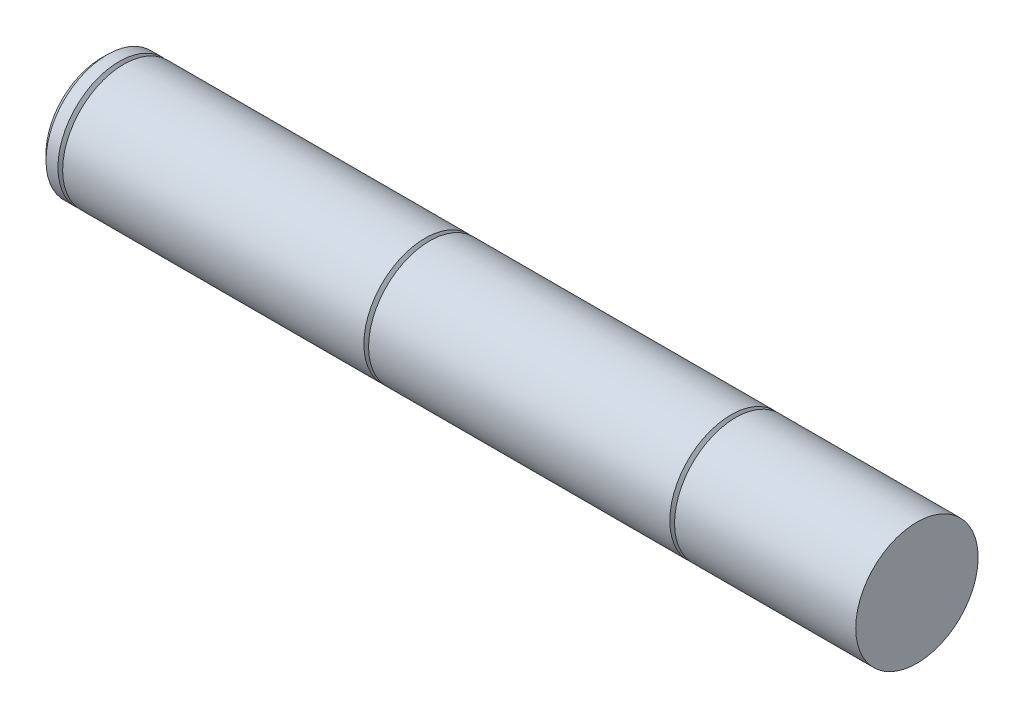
ISO-10303-21;
HEADER;
FILE_DESCRIPTION(('STEP AP214'),'2;1');
FILE_NAME('part.step','',(''),(''),'','','');
FILE_SCHEMA(('AUTOMOTIVE_DESIGN { 1 0 10303 214 1 1 1 1 }'));
ENDSEC;
DATA;
#1=APPLICATION_CONTEXT('core data for automotive mechanical design processes');
#2=APPLICATION_PROTOCOL_DEFINITION('international standard','automotive_design',2000,#1);
#3=PRODUCT_CONTEXT('',#1,'mechanical');
#4=PRODUCT('Part','Part','',(#3));
#5=PRODUCT_RELATED_PRODUCT_CATEGORY('part','',(#4));
#6=PRODUCT_DEFINITION_FORMATION('','',#4);
#7=PRODUCT_DEFINITION_CONTEXT('part definition',#1,'design');
#8=PRODUCT_DEFINITION('design','',#6,#7);
#9=PRODUCT_DEFINITION_SHAPE('','',#8);
#10=(LENGTH_UNIT() NAMED_UNIT(*) SI_UNIT(.MILLI.,.METRE.));
#11=(NAMED_UNIT(*) PLANE_ANGLE_UNIT() SI_UNIT($,.RADIAN.));
#12=(NAMED_UNIT(*) SI_UNIT($,.STERADIAN.) SOLID_ANGLE_UNIT());
#13=UNCERTAINTY_MEASURE_WITH_UNIT(LENGTH_MEASURE(1.E-05),#10,'distance_accuracy_value','');
#14=(GEOMETRIC_REPRESENTATION_CONTEXT(3) GLOBAL_UNCERTAINTY_ASSIGNED_CONTEXT((#13)) GLOBAL_UNIT_ASSIGNED_CONTEXT((#10,
#11,#12)) REPRESENTATION_CONTEXT('',''));
#15=CARTESIAN_POINT('',(0.,0.,0.));
#16=DIRECTION('',(0.,0.,1.));
#17=DIRECTION('',(1.,0.,0.));
#18=AXIS2_PLACEMENT_3D('',#15,#16,#17);
#19=CARTESIAN_POINT('',(0.,0.,0.));
#20=DIRECTION('',(1.,0.,0.));
#21=DIRECTION('',(0.,0.,-1.));
#22=AXIS2_PLACEMENT_3D('',#19,#20,#21);
#23=PLANE('',#22);
#24=CARTESIAN_POINT('',(0.,0.,0.));
#25=DIRECTION('',(1.,0.,0.));
#26=DIRECTION('',(0.,0.,-1.));
#27=AXIS2_PLACEMENT_3D('',#24,#25,#26);
#28=CIRCLE('',#27,13.5);
#29=CARTESIAN_POINT('',(0.,0.,-13.5));
#30=VERTEX_POINT('',#29);
#31=EDGE_CURVE('E17',#30,#30,#28,.T.);
#32=ORIENTED_EDGE('',*,*,#31,.F.);
#33=EDGE_LOOP('',(#32));
#34=FACE_BOUND('',#33,.T.);
#35=ADVANCED_FACE('F14',(#34),#23,.F.);
#36=CARTESIAN_POINT('',(1.50000000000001,0.,0.));
#37=DIRECTION('',(1.,0.,0.));
#38=DIRECTION('',(0.,0.,-1.));
#39=AXIS2_PLACEMENT_3D('',#36,#37,#38);
#40=CONICAL_SURFACE('',#39,15.,0.78539816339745);
#41=CARTESIAN_POINT('',(1.50000000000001,0.,0.));
#42=DIRECTION('',(-1.,0.,0.));
#43=DIRECTION('',(0.,0.,1.));
#44=AXIS2_PLACEMENT_3D('',#41,#42,#43);
#45=CIRCLE('',#44,15.);
#46=CARTESIAN_POINT('',(1.50000000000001,0.,15.));
#47=VERTEX_POINT('',#46);
#48=EDGE_CURVE('E50',#47,#47,#45,.F.);
#49=ORIENTED_EDGE('',*,*,#48,.F.);
#50=EDGE_LOOP('',(#49));
#51=FACE_BOUND('',#50,.T.);
#52=ORIENTED_EDGE('',*,*,#31,.T.);
#53=EDGE_LOOP('',(#52));
#54=FACE_BOUND('',#53,.T.);
#55=ADVANCED_FACE('F173',(#51,#54),#40,.T.);
#56=CARTESIAN_POINT('',(-14.6487659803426,0.,0.));
#57=DIRECTION('',(-1.,0.,0.));
#58=DIRECTION('',(0.,0.,1.));
#59=AXIS2_PLACEMENT_3D('',#56,#57,#58);
#60=CYLINDRICAL_SURFACE('',#59,15.);
#61=ORIENTED_EDGE('',*,*,#48,.T.);
#62=EDGE_LOOP('',(#61));
#63=FACE_BOUND('',#62,.T.);
#64=CARTESIAN_POINT('',(4.42264973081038,0.,0.));
#65=DIRECTION('',(-1.,0.,0.));
#66=DIRECTION('',(0.,0.,1.));
#67=AXIS2_PLACEMENT_3D('',#64,#65,#66);
#68=CIRCLE('',#67,15.);
#69=CARTESIAN_POINT('',(4.42264973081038,0.,15.));
#70=VERTEX_POINT('',#69);
#71=EDGE_CURVE('E47',#70,#70,#68,.F.);
#72=ORIENTED_EDGE('',*,*,#71,.F.);
#73=EDGE_LOOP('',(#72));
#74=FACE_BOUND('',#73,.T.);
#75=ADVANCED_FACE('F69',(#63,#74),#60,.T.);
#76=CARTESIAN_POINT('',(4.42264973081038,0.,0.));
#77=DIRECTION('',(-1.,0.,0.));
#78=DIRECTION('',(0.,0.,1.));
#79=AXIS2_PLACEMENT_3D('',#76,#77,#78);
#80=CONICAL_SURFACE('',#79,15.,1.0471975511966);
#81=ORIENTED_EDGE('',*,*,#71,.T.);
#82=EDGE_LOOP('',(#81));
#83=FACE_BOUND('',#82,.T.);
#84=CARTESIAN_POINT('',(5.00000000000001,0.,0.));
#85=DIRECTION('',(1.,0.,0.));
#86=DIRECTION('',(0.,0.,-1.));
#87=AXIS2_PLACEMENT_3D('',#84,#85,#86);
#88=CIRCLE('',#87,14.);
#89=CARTESIAN_POINT('',(5.00000000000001,0.,-14.));
#90=VERTEX_POINT('',#89);
#91=EDGE_CURVE('E44',#90,#90,#88,.T.);
#92=ORIENTED_EDGE('',*,*,#91,.F.);
#93=EDGE_LOOP('',(#92));
#94=FACE_BOUND('',#93,.T.);
#95=ADVANCED_FACE('F60',(#83,#94),#80,.T.);
#96=CARTESIAN_POINT('',(200.,15.,0.));
#97=DIRECTION('',(-1.,0.,0.));
#98=DIRECTION('',(0.,0.,1.));
#99=AXIS2_PLACEMENT_3D('',#96,#97,#98);
#100=PLANE('',#99);
#101=CARTESIAN_POINT('',(200.,0.,0.));
#102=DIRECTION('',(-1.,0.,0.));
#103=DIRECTION('',(0.,0.,1.));
#104=AXIS2_PLACEMENT_3D('',#101,#102,#103);
#105=CIRCLE('',#104,15.);
#106=CARTESIAN_POINT('',(200.,0.,15.));
#107=VERTEX_POINT('',#106);
#108=EDGE_CURVE('E43',#107,#107,#105,.T.);
#109=ORIENTED_EDGE('',*,*,#108,.F.);
#110=EDGE_LOOP('',(#109));
#111=FACE_BOUND('',#110,.T.);
#112=ADVANCED_FACE('F57',(#111),#100,.F.);
#113=CARTESIAN_POINT('',(5.57735026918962,0.,0.));
#114=DIRECTION('',(1.,0.,0.));
#115=DIRECTION('',(0.,0.,-1.));
#116=AXIS2_PLACEMENT_3D('',#113,#114,#115);
#117=CONICAL_SURFACE('',#116,15.,1.04719755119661);
#118=CARTESIAN_POINT('',(5.57735026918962,0.,0.));
#119=DIRECTION('',(-1.,0.,0.));
#120=DIRECTION('',(0.,0.,1.));
#121=AXIS2_PLACEMENT_3D('',#118,#119,#120);
#122=CIRCLE('',#121,15.);
#123=CARTESIAN_POINT('',(5.57735026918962,0.,15.));
#124=VERTEX_POINT('',#123);
#125=EDGE_CURVE('E40',#124,#124,#122,.F.);
#126=ORIENTED_EDGE('',*,*,#125,.F.);
#127=EDGE_LOOP('',(#126));
#128=FACE_BOUND('',#127,.T.);
#129=ORIENTED_EDGE('',*,*,#91,.T.);
#130=EDGE_LOOP('',(#129));
#131=FACE_BOUND('',#130,.T.);
#132=ADVANCED_FACE('F59',(#128,#131),#117,.T.);
#133=CARTESIAN_POINT('',(-14.6487659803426,0.,0.));
#134=DIRECTION('',(-1.,0.,0.));
#135=DIRECTION('',(0.,0.,1.));
#136=AXIS2_PLACEMENT_3D('',#133,#134,#135);
#137=CYLINDRICAL_SURFACE('',#136,15.);
#138=CARTESIAN_POINT('',(155.57735026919,0.,0.));
#139=DIRECTION('',(1.,0.,0.));
#140=DIRECTION('',(0.,0.,-1.));
#141=AXIS2_PLACEMENT_3D('',#138,#139,#140);
#142=CIRCLE('',#141,15.);
#143=CARTESIAN_POINT('',(155.57735026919,0.,-15.));
#144=VERTEX_POINT('',#143);
#145=EDGE_CURVE('E37',#144,#144,#142,.F.);
#146=ORIENTED_EDGE('',*,*,#145,.F.);
#147=EDGE_LOOP('',(#146));
#148=FACE_BOUND('',#147,.T.);
#149=ORIENTED_EDGE('',*,*,#108,.T.);
#150=EDGE_LOOP('',(#149));
#151=FACE_BOUND('',#150,.T.);
#152=ADVANCED_FACE('F55',(#148,#151),#137,.T.);
#153=CARTESIAN_POINT('',(-14.6487659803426,0.,0.));
#154=DIRECTION('',(-1.,0.,0.));
#155=DIRECTION('',(0.,0.,1.));
#156=AXIS2_PLACEMENT_3D('',#153,#154,#155);
#157=CYLINDRICAL_SURFACE('',#156,15.);
#158=ORIENTED_EDGE('',*,*,#125,.T.);
#159=EDGE_LOOP('',(#158));
#160=FACE_BOUND('',#159,.T.);
#161=CARTESIAN_POINT('',(79.4226497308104,0.,0.));
#162=DIRECTION('',(-1.,0.,0.));
#163=DIRECTION('',(0.,0.,1.));
#164=AXIS2_PLACEMENT_3D('',#161,#162,#163);
#165=CIRCLE('',#164,15.);
#166=CARTESIAN_POINT('',(79.4226497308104,0.,15.));
#167=VERTEX_POINT('',#166);
#168=EDGE_CURVE('E34',#167,#167,#165,.F.);
#169=ORIENTED_EDGE('',*,*,#168,.F.);
#170=EDGE_LOOP('',(#169));
#171=FACE_BOUND('',#170,.T.);
#172=ADVANCED_FACE('F94',(#160,#171),#157,.T.);
#173=CARTESIAN_POINT('',(155.57735026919,0.,0.));
#174=DIRECTION('',(1.,0.,0.));
#175=DIRECTION('',(0.,0.,-1.));
#176=AXIS2_PLACEMENT_3D('',#173,#174,#175);
#177=CONICAL_SURFACE('',#176,15.,1.04719755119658);
#178=ORIENTED_EDGE('',*,*,#145,.T.);
#179=EDGE_LOOP('',(#178));
#180=FACE_BOUND('',#179,.T.);
#181=CARTESIAN_POINT('',(155.,0.,0.));
#182=DIRECTION('',(-1.,0.,0.));
#183=DIRECTION('',(0.,0.,1.));
#184=AXIS2_PLACEMENT_3D('',#181,#182,#183);
#185=CIRCLE('',#184,14.);
#186=CARTESIAN_POINT('',(155.,0.,14.));
#187=VERTEX_POINT('',#186);
#188=EDGE_CURVE('E31',#187,#187,#185,.T.);
#189=ORIENTED_EDGE('',*,*,#188,.F.);
#190=EDGE_LOOP('',(#189));
#191=FACE_BOUND('',#190,.T.);
#192=ADVANCED_FACE('F90',(#180,#191),#177,.T.);
#193=CARTESIAN_POINT('',(79.4226497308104,0.,0.));
#194=DIRECTION('',(-1.,0.,0.));
#195=DIRECTION('',(0.,0.,1.));
#196=AXIS2_PLACEMENT_3D('',#193,#194,#195);
#197=CONICAL_SURFACE('',#196,15.,1.04719755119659);
#198=ORIENTED_EDGE('',*,*,#168,.T.);
#199=EDGE_LOOP('',(#198));
#200=FACE_BOUND('',#199,.T.);
#201=CARTESIAN_POINT('',(80.,0.,0.));
#202=DIRECTION('',(1.,0.,0.));
#203=DIRECTION('',(0.,0.,-1.));
#204=AXIS2_PLACEMENT_3D('',#201,#202,#203);
#205=CIRCLE('',#204,14.);
#206=CARTESIAN_POINT('',(80.,0.,-14.));
#207=VERTEX_POINT('',#206);
#208=EDGE_CURVE('E26',#207,#207,#205,.T.);
#209=ORIENTED_EDGE('',*,*,#208,.F.);
#210=EDGE_LOOP('',(#209));
#211=FACE_BOUND('',#210,.T.);
#212=ADVANCED_FACE('F86',(#200,#211),#197,.T.);
#213=CARTESIAN_POINT('',(154.42264973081,0.,0.));
#214=DIRECTION('',(-1.,0.,0.));
#215=DIRECTION('',(0.,0.,1.));
#216=AXIS2_PLACEMENT_3D('',#213,#214,#215);
#217=CONICAL_SURFACE('',#216,15.,1.0471975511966);
#218=CARTESIAN_POINT('',(154.42264973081,0.,0.));
#219=DIRECTION('',(-1.,0.,0.));
#220=DIRECTION('',(0.,0.,1.));
#221=AXIS2_PLACEMENT_3D('',#218,#219,#220);
#222=CIRCLE('',#221,15.);
#223=CARTESIAN_POINT('',(154.42264973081,0.,15.));
#224=VERTEX_POINT('',#223);
#225=EDGE_CURVE('E21',#224,#224,#222,.T.);
#226=ORIENTED_EDGE('',*,*,#225,.F.);
#227=EDGE_LOOP('',(#226));
#228=FACE_BOUND('',#227,.T.);
#229=ORIENTED_EDGE('',*,*,#188,.T.);
#230=EDGE_LOOP('',(#229));
#231=FACE_BOUND('',#230,.T.);
#232=ADVANCED_FACE('F79',(#228,#231),#217,.T.);
#233=CARTESIAN_POINT('',(80.5773502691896,0.,0.));
#234=DIRECTION('',(1.,0.,0.));
#235=DIRECTION('',(0.,0.,-1.));
#236=AXIS2_PLACEMENT_3D('',#233,#234,#235);
#237=CONICAL_SURFACE('',#236,15.,1.04719755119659);
#238=CARTESIAN_POINT('',(80.5773502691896,0.,0.));
#239=DIRECTION('',(-1.,0.,0.));
#240=DIRECTION('',(0.,0.,1.));
#241=AXIS2_PLACEMENT_3D('',#238,#239,#240);
#242=CIRCLE('',#241,15.);
#243=CARTESIAN_POINT('',(80.5773502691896,0.,15.));
#244=VERTEX_POINT('',#243);
#245=EDGE_CURVE('E10',#244,#244,#242,.F.);
#246=ORIENTED_EDGE('',*,*,#245,.F.);
#247=EDGE_LOOP('',(#246));
#248=FACE_BOUND('',#247,.T.);
#249=ORIENTED_EDGE('',*,*,#208,.T.);
#250=EDGE_LOOP('',(#249));
#251=FACE_BOUND('',#250,.T.);
#252=ADVANCED_FACE('F74',(#248,#251),#237,.T.);
#253=CARTESIAN_POINT('',(-14.6487659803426,0.,0.));
#254=DIRECTION('',(-1.,0.,0.));
#255=DIRECTION('',(0.,0.,1.));
#256=AXIS2_PLACEMENT_3D('',#253,#254,#255);
#257=CYLINDRICAL_SURFACE('',#256,15.);
#258=ORIENTED_EDGE('',*,*,#245,.T.);
#259=EDGE_LOOP('',(#258));
#260=FACE_BOUND('',#259,.T.);
#261=ORIENTED_EDGE('',*,*,#225,.T.);
#262=EDGE_LOOP('',(#261));
#263=FACE_BOUND('',#262,.T.);
#264=ADVANCED_FACE('F72',(#260,#263),#257,.T.);
#265=CLOSED_SHELL('',(#35,#55,#75,#95,#112,#132,#152,#172,#192,#212,#232,#252,#264));
#266=MANIFOLD_SOLID_BREP('B1',#265);
#267=ADVANCED_BREP_SHAPE_REPRESENTATION('',(#18,#266),#14);
#268=SHAPE_DEFINITION_REPRESENTATION(#9,#267);
ENDSEC;
END-ISO-10303-21;
